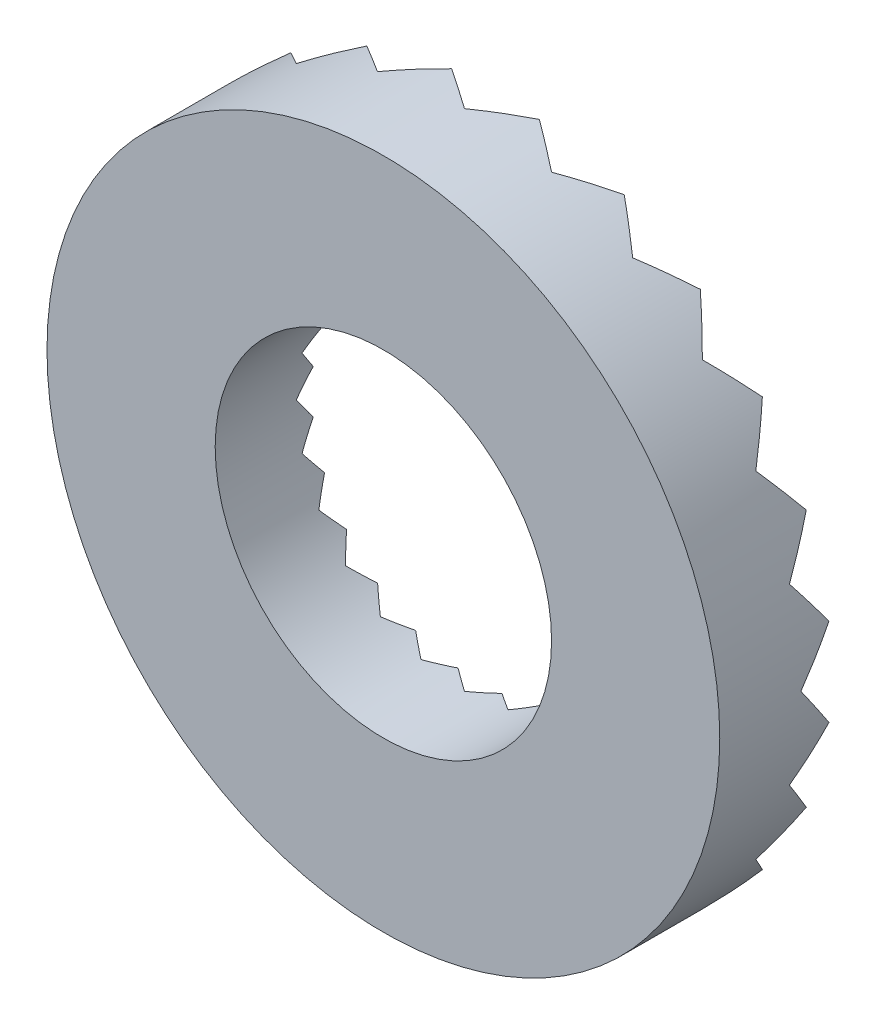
from build123d import *

# Parameters (mm, degrees)
ESQUISSE1_R                  = 7.25
EXTRUSION1_DEPTH             = 4.5
ESQUISSE2_R                  = 6
EXTRUSION2_DEPTH             = 5
PER_AGE1_D                   = 5.3
PER_AGE1_DEPTH               = 9.5
PER_AGE1_CBORE_D             = 10.3
PER_AGE1_CBORE_DEPTH         = 2.5
PER_AGE1_TIP                 = 1.59228064
CONG_1_R                     = 1
R_P_TITION_CIRCULAIRE1_COUNT = 24
ESQUISSE11_R                 = 3
EXTRUSION4_DEPTH             = 14
ESQUISSE8_R                  = 6
EXTRUSION3_DEPTH             = 4


with BuildPart() as part:
    # Esquisse1 → Extrusion1 (new body)
    with BuildSketch(Plane.XY):
        Circle(ESQUISSE1_R)
    extrude(amount=-EXTRUSION1_DEPTH)

    # Esquisse2 → Extrusion2 (add)
    with BuildSketch(Plane.XY):
        Circle(ESQUISSE2_R)
    extrude(amount=EXTRUSION2_DEPTH)

    # Per_age1
    with Locations(Plane(origin=(0, 0, -4.5), x_dir=(-1, 0, 0), z_dir=(0, 0, -1))):
        with Locations((0, 0)):
            CounterBoreHole(PER_AGE1_D / 2, PER_AGE1_CBORE_D / 2, PER_AGE1_CBORE_DEPTH, depth=PER_AGE1_DEPTH)
            with Locations((0, 0, -(PER_AGE1_DEPTH + PER_AGE1_TIP / 2))):  # 118° drill point
                Cone(0, PER_AGE1_D / 2, PER_AGE1_TIP, mode=Mode.SUBTRACT)

    # Cong_1
    cong_1_edges = [part.edges().sort_by_distance(p)[0] for p in [
        (-7.25, 0, -4.5),
    ]]
    fillet(cong_1_edges, radius=CONG_1_R)

    # Esquisse7 → Enl_vement de mati_re-Lissage1 section 0
    with BuildSketch(Plane(origin=(0.342935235, 2.60485172, 5), x_dir=(-0.9914448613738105, 0.1305261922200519, 0), z_dir=(0.1305261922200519, 0.9914448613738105, 0))):
        with BuildLine():
            Line((-0.345894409, 0), (0, -0.242197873))
            Line((0, -0.242197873), (0.345894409, 0))
            Line((0.345894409, 0), (-0.345894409, 0))
        make_face()
    # Esquisse6 → Enl_vement de mati_re-Lissage1 section 1
    with BuildSketch(Plane(origin=(0.808809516, 6.143518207, 5), x_dir=(-0.9914448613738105, 0.1305261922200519, 0), z_dir=(0.1305261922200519, 0.9914448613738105, 0))):
        with BuildLine():
            Line((-0.815788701, 0), (0, -0.571221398))
            Line((0, -0.571221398), (0.815788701, 0))
            Line((0.815788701, 0), (-0.815788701, 0))
        make_face()
    enl_vement_de_mati_re_lissage1 = loft(mode=Mode.SUBTRACT)

    # R_p_tition circulaire1: Enl_vement de mati_re-Lissage1 ×24 about axis
    r_p_tition_circulaire1_axis = Axis((0, 0, 0), (0, 0, 1))
    for i in range(1, R_P_TITION_CIRCULAIRE1_COUNT):
        add(enl_vement_de_mati_re_lissage1.rotate(r_p_tition_circulaire1_axis, i * 360 / R_P_TITION_CIRCULAIRE1_COUNT), mode=Mode.SUBTRACT)

    # Esquisse11 → Extrusion4 (add)
    with BuildSketch(Plane(origin=(0, 0, -2), x_dir=(-1, 0, 0), z_dir=(0, 0, -1))):
        Circle(ESQUISSE11_R)
    extrude(amount=-EXTRUSION4_DEPTH)


with BuildPart() as body_2:
    # Esquisse8 → Extrusion3 (new body)
    with BuildSketch(Plane.XY.offset(2.446895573)):
        Circle(ESQUISSE8_R)
    extrude(amount=EXTRUSION3_DEPTH)

    # Combiner1: cut part
    add(part.part, mode=Mode.SUBTRACT)


solid = body_2.part
